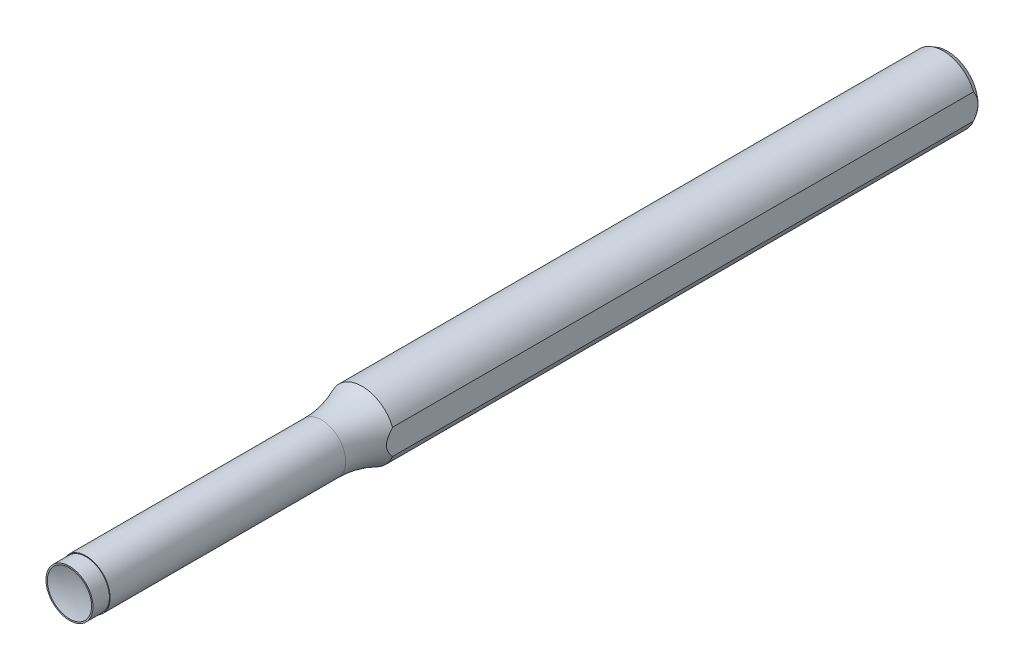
from build123d import *

# Parameters (mm, degrees)
SKETCH1_R           = 4.765
BOSS_EXTRUDE1_DEPTH = 127
SKETCH2_OUTSIDE_W   = 37.072
SKETCH2_OUTSIDE_H   = 37.072
SKETCH2_OUTSIDE_R   = 3.5
CUT_EXTRUDE1_DEPTH  = 42.333333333
SKETCH3_OUTSIDE_W   = 37.072
SKETCH3_OUTSIDE_H   = 37.072
SKETCH3_OUTSIDE_R   = 3.4
CUT_EXTRUDE2_DEPTH  = 2.3825
CHAMFER1_SIZE       = 0.635333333
CHAMFER1_SIZE2      = 0.366809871
SKETCH7_W           = 3.666687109
SKETCH7_H           = 3.66668711
CUT_EXTRUDE3_DEPTH  = 128.178655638


with BuildPart() as part:
    # Sketch1 → Boss-Extrude1 (new body)
    with BuildSketch(Plane.XY):
        Circle(SKETCH1_R)
    extrude(amount=-BOSS_EXTRUDE1_DEPTH)

    # Sketch2 outside → Cut-Extrude1 (cut)
    with BuildSketch(Plane.XY):
        Rectangle(SKETCH2_OUTSIDE_W, SKETCH2_OUTSIDE_H)
        Circle(SKETCH2_OUTSIDE_R, mode=Mode.SUBTRACT)
    extrude(amount=-CUT_EXTRUDE1_DEPTH, mode=Mode.SUBTRACT)

    # Sketch3 outside → Cut-Extrude2 (cut)
    with BuildSketch(Plane.XY):
        Rectangle(SKETCH3_OUTSIDE_W, SKETCH3_OUTSIDE_H)
        Circle(SKETCH3_OUTSIDE_R, mode=Mode.SUBTRACT)
    extrude(amount=-CUT_EXTRUDE2_DEPTH, mode=Mode.SUBTRACT)

    # Sketch4 → Cut-Revolve1 (revolve, cut)
    with BuildSketch(Plane(origin=(0, 0, 0), x_dir=(0, 0, -1), z_dir=(1, 0, 0)), mode=Mode.PRIVATE) as cut_revolve1_sk:
        with BuildLine():
            Line((0, 0), (0, 3.2))
            ThreePointArc((0, 3.2), (0.413966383, 1.623742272), (0.553313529, 0))
            Line((0.553313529, 0), (0, 0))
        make_face()
    revolve(cut_revolve1_sk.sketch.rotate(Axis((0, 0, 0), (0, 0, -1)), 180), axis=Axis((0, 0, 0), (0, 0, -1)), mode=Mode.SUBTRACT)

    # Chamfer1
    chamfer1_edges = [part.edges().sort_by_distance(p)[0] for p in [
        (-4.765, 0, -127),
    ]]
    chamfer1_side = [part.faces().sort_by_distance(p)[0] for p in [
        (-4.765, 0, -84.666666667),
    ]]
    chamfer(chamfer1_edges, length=CHAMFER1_SIZE, length2=CHAMFER1_SIZE2, reference=chamfer1_side[0])

    # Sketch5 → Revolve1 (revolve)
    with BuildSketch(Plane(origin=(0, 0, 0), x_dir=(0, 0, -1), z_dir=(1, 0, 0)), mode=Mode.PRIVATE) as revolve1_sk:
        with BuildLine():
            Line((42.333333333, 0), (36.454037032, 0))
            Line((36.454037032, 0), (36.454037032, 3.5))
            ThreePointArc((36.454037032, 3.5), (39.460960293, 3.819827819), (42.333333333, 4.765))
            Line((42.333333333, 4.765), (42.333333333, 0))
        make_face()
    revolve(revolve1_sk.sketch.rotate(Axis((0, 0, -42.333333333), (0, 0, 1)), 270), axis=Axis((0, 0, -42.333333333), (0, 0, 1)))

    # Sketch7 → Cut-Extrude3 (cut, through all)
    with BuildSketch(Plane(origin=(0, 0, -127), x_dir=(-1, 0, 0), z_dir=(0, 0, -1))):
        with Locations((-6.231533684, 0)):
            Rectangle(SKETCH7_W, SKETCH7_H)
    extrude(amount=-CUT_EXTRUDE3_DEPTH, mode=Mode.SUBTRACT)


solid = part.part
